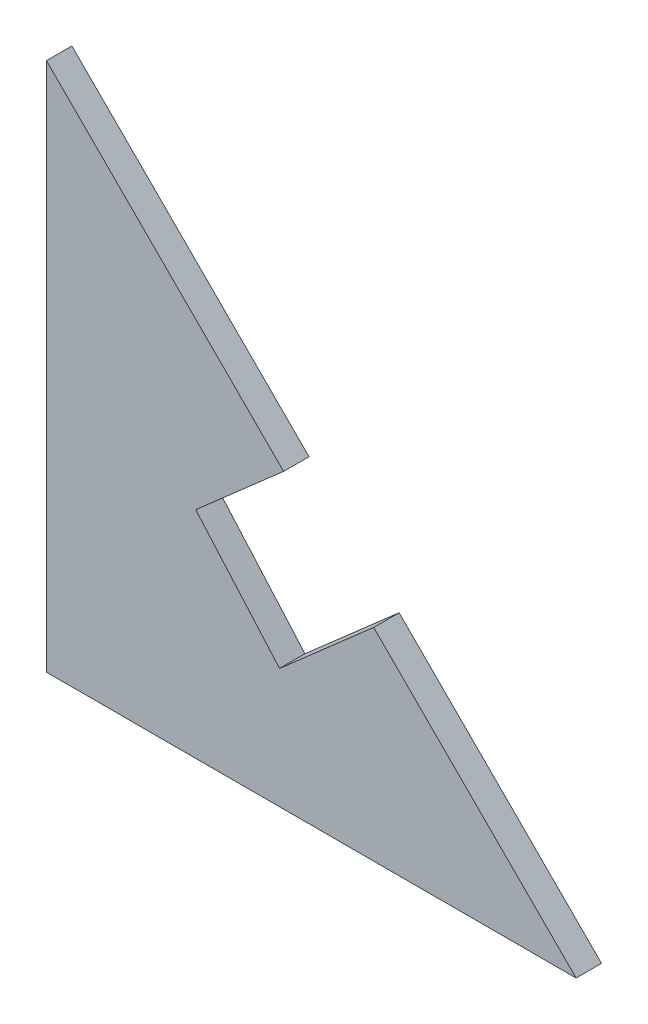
ISO-10303-21;
HEADER;
FILE_DESCRIPTION(('STEP AP214'),'2;1');
FILE_NAME('part.step','',(''),(''),'','','');
FILE_SCHEMA(('AUTOMOTIVE_DESIGN { 1 0 10303 214 1 1 1 1 }'));
ENDSEC;
DATA;
#1=APPLICATION_CONTEXT('core data for automotive mechanical design processes');
#2=APPLICATION_PROTOCOL_DEFINITION('international standard','automotive_design',2000,#1);
#3=PRODUCT_CONTEXT('',#1,'mechanical');
#4=PRODUCT('Part','Part','',(#3));
#5=PRODUCT_RELATED_PRODUCT_CATEGORY('part','',(#4));
#6=PRODUCT_DEFINITION_FORMATION('','',#4);
#7=PRODUCT_DEFINITION_CONTEXT('part definition',#1,'design');
#8=PRODUCT_DEFINITION('design','',#6,#7);
#9=PRODUCT_DEFINITION_SHAPE('','',#8);
#10=(LENGTH_UNIT() NAMED_UNIT(*) SI_UNIT(.MILLI.,.METRE.));
#11=(NAMED_UNIT(*) PLANE_ANGLE_UNIT() SI_UNIT($,.RADIAN.));
#12=(NAMED_UNIT(*) SI_UNIT($,.STERADIAN.) SOLID_ANGLE_UNIT());
#13=UNCERTAINTY_MEASURE_WITH_UNIT(LENGTH_MEASURE(1.E-05),#10,'distance_accuracy_value','');
#14=(GEOMETRIC_REPRESENTATION_CONTEXT(3) GLOBAL_UNCERTAINTY_ASSIGNED_CONTEXT((#13)) GLOBAL_UNIT_ASSIGNED_CONTEXT((#10,
#11,#12)) REPRESENTATION_CONTEXT('',''));
#15=CARTESIAN_POINT('',(0.,0.,0.));
#16=DIRECTION('',(0.,0.,1.));
#17=DIRECTION('',(1.,0.,0.));
#18=AXIS2_PLACEMENT_3D('',#15,#16,#17);
#19=CARTESIAN_POINT('',(70.442811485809,101.67531810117,36.001));
#20=DIRECTION('',(-0.751859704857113,-0.659323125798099,0.));
#21=DIRECTION('',(-0.659323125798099,0.751859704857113,0.));
#22=AXIS2_PLACEMENT_3D('',#19,#20,#21);
#23=PLANE('',#22);
#24=DIRECTION('',(0.659323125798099,-0.751859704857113,0.));
#25=VECTOR('',#24,1.);
#26=CARTESIAN_POINT('',(77.636634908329,93.471835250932,0.));
#27=LINE('',#26,#25);
#28=CARTESIAN_POINT('',(70.442811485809,101.67531810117,0.));
#29=VERTEX_POINT('',#28);
#30=CARTESIAN_POINT('',(110.00351767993,56.562232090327,0.));
#31=VERTEX_POINT('',#30);
#32=EDGE_CURVE('E133',#29,#31,#27,.T.);
#33=ORIENTED_EDGE('',*,*,#32,.F.);
#34=DIRECTION('',(0.,0.,-1.));
#35=VECTOR('',#34,1.);
#36=CARTESIAN_POINT('',(70.442811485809,101.67531810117,36.001));
#37=LINE('',#36,#35);
#38=CARTESIAN_POINT('',(70.442811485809,101.67531810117,12.));
#39=VERTEX_POINT('',#38);
#40=EDGE_CURVE('E10',#39,#29,#37,.T.);
#41=ORIENTED_EDGE('',*,*,#40,.F.);
#42=DIRECTION('',(0.659323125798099,-0.751859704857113,0.));
#43=VECTOR('',#42,1.);
#44=CARTESIAN_POINT('',(77.636634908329,93.471835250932,12.));
#45=LINE('',#44,#43);
#46=CARTESIAN_POINT('',(110.00351767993,56.562232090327,12.));
#47=VERTEX_POINT('',#46);
#48=EDGE_CURVE('E140',#39,#47,#45,.T.);
#49=ORIENTED_EDGE('',*,*,#48,.T.);
#50=DIRECTION('',(0.,0.,-1.));
#51=VECTOR('',#50,1.);
#52=CARTESIAN_POINT('',(110.00351767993,56.562232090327,36.001));
#53=LINE('',#52,#51);
#54=EDGE_CURVE('E24',#47,#31,#53,.T.);
#55=ORIENTED_EDGE('',*,*,#54,.T.);
#56=EDGE_LOOP('',(#33,#41,#49,#55));
#57=FACE_BOUND('',#56,.T.);
#58=ADVANCED_FACE('F16',(#57),#23,.F.);
#59=CARTESIAN_POINT('',(543.97150660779,516.92355843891,36.001));
#60=DIRECTION('',(0.659323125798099,-0.751859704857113,0.));
#61=DIRECTION('',(0.,0.,-1.));
#62=AXIS2_PLACEMENT_3D('',#59,#60,#61);
#63=PLANE('',#62);
#64=ORIENTED_EDGE('',*,*,#40,.T.);
#65=DIRECTION('',(0.751859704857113,0.659323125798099,0.));
#66=VECTOR('',#65,1.);
#67=CARTESIAN_POINT('',(308.98610370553,310.85943589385,0.));
#68=LINE('',#67,#66);
#69=CARTESIAN_POINT('',(111.93725064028,138.06274935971,0.));
#70=VERTEX_POINT('',#69);
#71=EDGE_CURVE('E144',#29,#70,#68,.T.);
#72=ORIENTED_EDGE('',*,*,#71,.T.);
#73=DIRECTION('',(0.,0.,1.));
#74=VECTOR('',#73,1.);
#75=CARTESIAN_POINT('',(111.93725064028,138.06274935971,18.0005));
#76=LINE('',#75,#74);
#77=CARTESIAN_POINT('',(111.93725064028,138.06274935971,12.));
#78=VERTEX_POINT('',#77);
#79=EDGE_CURVE('E36',#70,#78,#76,.T.);
#80=ORIENTED_EDGE('',*,*,#79,.T.);
#81=DIRECTION('',(0.751859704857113,0.659323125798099,0.));
#82=VECTOR('',#81,1.);
#83=CARTESIAN_POINT('',(308.98610370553,310.85943589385,12.));
#84=LINE('',#83,#82);
#85=EDGE_CURVE('E164',#39,#78,#84,.T.);
#86=ORIENTED_EDGE('',*,*,#85,.F.);
#87=EDGE_LOOP('',(#64,#72,#80,#86));
#88=FACE_BOUND('',#87,.T.);
#89=ADVANCED_FACE('F181',(#88),#63,.T.);
#90=CARTESIAN_POINT('',(583.53221280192,471.81047242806,36.001));
#91=DIRECTION('',(0.659323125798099,-0.751859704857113,0.));
#92=DIRECTION('',(0.,0.,-1.));
#93=AXIS2_PLACEMENT_3D('',#90,#91,#92);
#94=PLANE('',#93);
#95=DIRECTION('',(0.751859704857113,0.659323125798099,0.));
#96=VECTOR('',#95,1.);
#97=CARTESIAN_POINT('',(348.54680989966,265.74634988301,12.));
#98=LINE('',#97,#96);
#99=CARTESIAN_POINT('',(154.45619198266,95.543808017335,12.));
#100=VERTEX_POINT('',#99);
#101=EDGE_CURVE('E132',#47,#100,#98,.T.);
#102=ORIENTED_EDGE('',*,*,#101,.T.);
#103=DIRECTION('',(0.,0.,1.));
#104=VECTOR('',#103,1.);
#105=CARTESIAN_POINT('',(154.45619198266,95.543808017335,18.0005));
#106=LINE('',#105,#104);
#107=CARTESIAN_POINT('',(154.45619198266,95.543808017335,0.));
#108=VERTEX_POINT('',#107);
#109=EDGE_CURVE('E147',#108,#100,#106,.T.);
#110=ORIENTED_EDGE('',*,*,#109,.F.);
#111=DIRECTION('',(0.751859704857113,0.659323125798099,0.));
#112=VECTOR('',#111,1.);
#113=CARTESIAN_POINT('',(348.54680989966,265.74634988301,0.));
#114=LINE('',#113,#112);
#115=EDGE_CURVE('E129',#31,#108,#114,.T.);
#116=ORIENTED_EDGE('',*,*,#115,.F.);
#117=ORIENTED_EDGE('',*,*,#54,.F.);
#118=EDGE_LOOP('',(#102,#110,#116,#117));
#119=FACE_BOUND('',#118,.T.);
#120=ADVANCED_FACE('F180',(#119),#94,.F.);
#121=CARTESIAN_POINT('',(250.,0.,0.));
#122=DIRECTION('',(-0.707106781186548,-0.707106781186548,0.));
#123=DIRECTION('',(-0.707106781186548,0.707106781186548,0.));
#124=AXIS2_PLACEMENT_3D('',#121,#122,#123);
#125=PLANE('',#124);
#126=DIRECTION('',(0.,0.,1.));
#127=VECTOR('',#126,1.);
#128=CARTESIAN_POINT('',(0.,250.,0.));
#129=LINE('',#128,#127);
#130=CARTESIAN_POINT('',(0.,250.,0.));
#131=VERTEX_POINT('',#130);
#132=CARTESIAN_POINT('',(0.,250.,12.));
#133=VERTEX_POINT('',#132);
#134=EDGE_CURVE('E102',#131,#133,#129,.T.);
#135=ORIENTED_EDGE('',*,*,#134,.T.);
#136=DIRECTION('',(-0.707106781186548,0.707106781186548,0.));
#137=VECTOR('',#136,1.);
#138=CARTESIAN_POINT('',(250.,0.,12.));
#139=LINE('',#138,#137);
#140=EDGE_CURVE('E168',#78,#133,#139,.T.);
#141=ORIENTED_EDGE('',*,*,#140,.F.);
#142=ORIENTED_EDGE('',*,*,#79,.F.);
#143=DIRECTION('',(-0.707106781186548,0.707106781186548,0.));
#144=VECTOR('',#143,1.);
#145=CARTESIAN_POINT('',(250.,0.,0.));
#146=LINE('',#145,#144);
#147=EDGE_CURVE('E152',#70,#131,#146,.T.);
#148=ORIENTED_EDGE('',*,*,#147,.T.);
#149=EDGE_LOOP('',(#135,#141,#142,#148));
#150=FACE_BOUND('',#149,.T.);
#151=ADVANCED_FACE('F203',(#150),#125,.F.);
#152=CARTESIAN_POINT('',(88.388347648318,88.388347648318,12.));
#153=DIRECTION('',(0.,0.,1.));
#154=DIRECTION('',(1.,0.,0.));
#155=AXIS2_PLACEMENT_3D('',#152,#153,#154);
#156=PLANE('',#155);
#157=DIRECTION('',(0.,-1.,0.));
#158=VECTOR('',#157,1.);
#159=CARTESIAN_POINT('',(0.,250.,12.));
#160=LINE('',#159,#158);
#161=CARTESIAN_POINT('',(0.,0.,12.));
#162=VERTEX_POINT('',#161);
#163=EDGE_CURVE('E107',#133,#162,#160,.T.);
#164=ORIENTED_EDGE('',*,*,#163,.T.);
#165=DIRECTION('',(1.,0.,0.));
#166=VECTOR('',#165,1.);
#167=CARTESIAN_POINT('',(0.,0.,12.));
#168=LINE('',#167,#166);
#169=CARTESIAN_POINT('',(250.,0.,12.));
#170=VERTEX_POINT('',#169);
#171=EDGE_CURVE('E115',#162,#170,#168,.T.);
#172=ORIENTED_EDGE('',*,*,#171,.T.);
#173=DIRECTION('',(-0.707106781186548,0.707106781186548,0.));
#174=VECTOR('',#173,1.);
#175=CARTESIAN_POINT('',(250.,0.,12.));
#176=LINE('',#175,#174);
#177=EDGE_CURVE('E151',#170,#100,#176,.T.);
#178=ORIENTED_EDGE('',*,*,#177,.T.);
#179=ORIENTED_EDGE('',*,*,#101,.F.);
#180=ORIENTED_EDGE('',*,*,#48,.F.);
#181=ORIENTED_EDGE('',*,*,#85,.T.);
#182=ORIENTED_EDGE('',*,*,#140,.T.);
#183=EDGE_LOOP('',(#164,#172,#178,#179,#180,#181,#182));
#184=FACE_BOUND('',#183,.T.);
#185=ADVANCED_FACE('F183',(#184),#156,.T.);
#186=CARTESIAN_POINT('',(88.388347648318,88.388347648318,0.));
#187=DIRECTION('',(0.,0.,1.));
#188=DIRECTION('',(1.,0.,0.));
#189=AXIS2_PLACEMENT_3D('',#186,#187,#188);
#190=PLANE('',#189);
#191=ORIENTED_EDGE('',*,*,#147,.F.);
#192=ORIENTED_EDGE('',*,*,#71,.F.);
#193=ORIENTED_EDGE('',*,*,#32,.T.);
#194=ORIENTED_EDGE('',*,*,#115,.T.);
#195=DIRECTION('',(-0.707106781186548,0.707106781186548,0.));
#196=VECTOR('',#195,1.);
#197=CARTESIAN_POINT('',(250.,0.,0.));
#198=LINE('',#197,#196);
#199=CARTESIAN_POINT('',(250.,0.,0.));
#200=VERTEX_POINT('',#199);
#201=EDGE_CURVE('E120',#200,#108,#198,.T.);
#202=ORIENTED_EDGE('',*,*,#201,.F.);
#203=DIRECTION('',(1.,0.,0.));
#204=VECTOR('',#203,1.);
#205=CARTESIAN_POINT('',(0.,0.,0.));
#206=LINE('',#205,#204);
#207=CARTESIAN_POINT('',(0.,0.,0.));
#208=VERTEX_POINT('',#207);
#209=EDGE_CURVE('E113',#208,#200,#206,.T.);
#210=ORIENTED_EDGE('',*,*,#209,.F.);
#211=DIRECTION('',(0.,-1.,0.));
#212=VECTOR('',#211,1.);
#213=CARTESIAN_POINT('',(0.,250.,0.));
#214=LINE('',#213,#212);
#215=EDGE_CURVE('E95',#131,#208,#214,.T.);
#216=ORIENTED_EDGE('',*,*,#215,.F.);
#217=EDGE_LOOP('',(#191,#192,#193,#194,#202,#210,#216));
#218=FACE_BOUND('',#217,.T.);
#219=ADVANCED_FACE('F118',(#218),#190,.F.);
#220=CARTESIAN_POINT('',(250.,0.,0.));
#221=DIRECTION('',(-0.707106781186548,-0.707106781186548,0.));
#222=DIRECTION('',(-0.707106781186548,0.707106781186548,0.));
#223=AXIS2_PLACEMENT_3D('',#220,#221,#222);
#224=PLANE('',#223);
#225=ORIENTED_EDGE('',*,*,#109,.T.);
#226=ORIENTED_EDGE('',*,*,#177,.F.);
#227=DIRECTION('',(0.,0.,1.));
#228=VECTOR('',#227,1.);
#229=CARTESIAN_POINT('',(250.,0.,0.));
#230=LINE('',#229,#228);
#231=EDGE_CURVE('E123',#200,#170,#230,.T.);
#232=ORIENTED_EDGE('',*,*,#231,.F.);
#233=ORIENTED_EDGE('',*,*,#201,.T.);
#234=EDGE_LOOP('',(#225,#226,#232,#233));
#235=FACE_BOUND('',#234,.T.);
#236=ADVANCED_FACE('F185',(#235),#224,.F.);
#237=CARTESIAN_POINT('',(0.,250.,0.));
#238=DIRECTION('',(1.,0.,0.));
#239=DIRECTION('',(0.,1.,0.));
#240=AXIS2_PLACEMENT_3D('',#237,#238,#239);
#241=PLANE('',#240);
#242=ORIENTED_EDGE('',*,*,#215,.T.);
#243=DIRECTION('',(0.,0.,1.));
#244=VECTOR('',#243,1.);
#245=CARTESIAN_POINT('',(0.,0.,0.));
#246=LINE('',#245,#244);
#247=EDGE_CURVE('E99',#208,#162,#246,.T.);
#248=ORIENTED_EDGE('',*,*,#247,.T.);
#249=ORIENTED_EDGE('',*,*,#163,.F.);
#250=ORIENTED_EDGE('',*,*,#134,.F.);
#251=EDGE_LOOP('',(#242,#248,#249,#250));
#252=FACE_BOUND('',#251,.T.);
#253=ADVANCED_FACE('F97',(#252),#241,.F.);
#254=CARTESIAN_POINT('',(0.,0.,0.));
#255=DIRECTION('',(0.,1.,0.));
#256=DIRECTION('',(1.,0.,0.));
#257=AXIS2_PLACEMENT_3D('',#254,#255,#256);
#258=PLANE('',#257);
#259=ORIENTED_EDGE('',*,*,#209,.T.);
#260=ORIENTED_EDGE('',*,*,#231,.T.);
#261=ORIENTED_EDGE('',*,*,#171,.F.);
#262=ORIENTED_EDGE('',*,*,#247,.F.);
#263=EDGE_LOOP('',(#259,#260,#261,#262));
#264=FACE_BOUND('',#263,.T.);
#265=ADVANCED_FACE('F111',(#264),#258,.F.);
#266=CLOSED_SHELL('',(#58,#89,#120,#151,#185,#219,#236,#253,#265));
#267=MANIFOLD_SOLID_BREP('B1',#266);
#268=ADVANCED_BREP_SHAPE_REPRESENTATION('',(#18,#267),#14);
#269=SHAPE_DEFINITION_REPRESENTATION(#9,#268);
ENDSEC;
END-ISO-10303-21;
